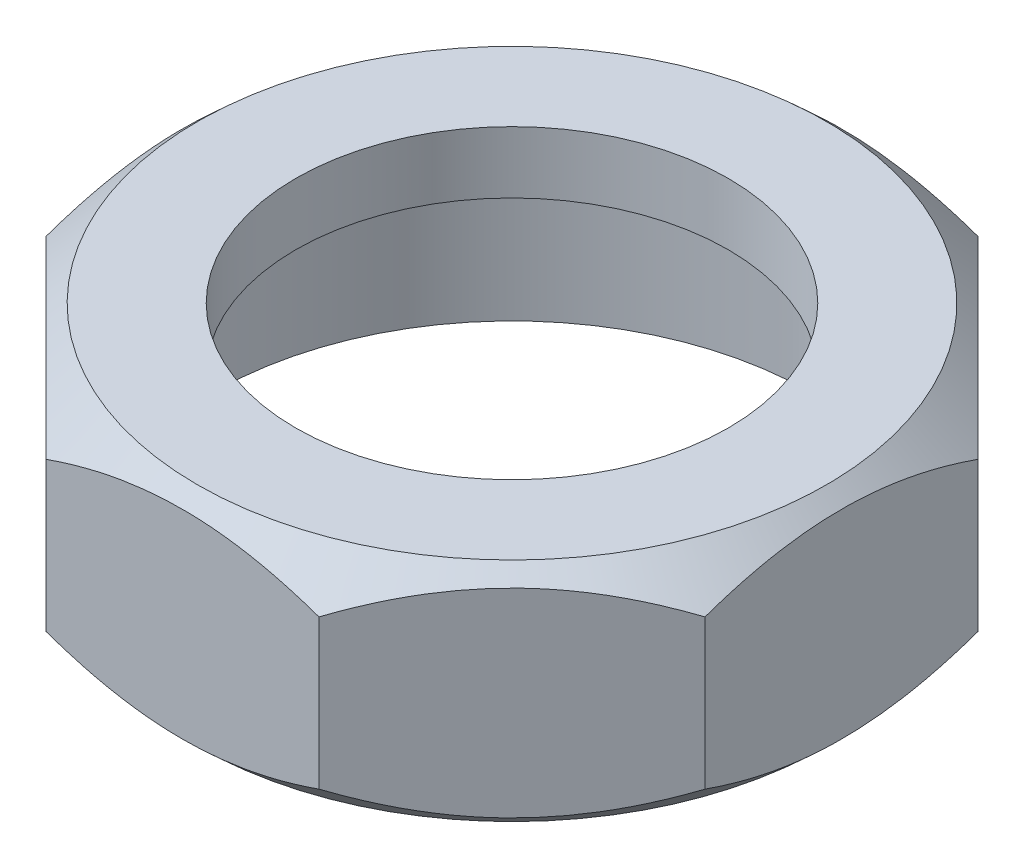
from build123d import *

# Parameters (mm, degrees)
SKETCH1_R           = 10.5
BOSS_EXTRUDE1_DEPTH = 5.5
SKETCH4_R           = 14.5
CUT_EXTRUDE1_DEPTH  = 8


with BuildPart() as part:
    # Sketch1 → Boss-Extrude1 (new, symmetric)
    with BuildSketch(Plane(origin=(0, 0, 0), x_dir=(1, 0, 0), z_dir=(0, 1, 0))):
        Polygon((6.627416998, 16), (-6.627416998, 16), (-16, 6.627416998), (-16, -6.627416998), (-6.627416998, -16), (6.627416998, -16), (16, -6.627416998), (16, 6.627416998), align=None)
        with Locations(Location((0, 0, 0), (0, 0, 270))):
            Circle(SKETCH1_R, mode=Mode.SUBTRACT)
    extrude(amount=BOSS_EXTRUDE1_DEPTH, both=True)

    # Sketch3 → Cut-Revolve1 (revolve, cut)
    with BuildSketch(Plane.XY, mode=Mode.PRIVATE) as cut_revolve1_sk:
        Polygon((-18.5, 2.534445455), (-18.5, 7.5), (-13.1, 7.5), align=None)
        Polygon((-18.5, -7.5), (-13.1, -7.5), (-18.5, -2.534445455), align=None)
    revolve(cut_revolve1_sk.sketch.rotate(Axis((0, 0, 0), (0, 1, 0)), 90), axis=Axis((0, 0, 0), (0, 1, 0)), mode=Mode.SUBTRACT)

    # Sketch4 → Cut-Extrude1 (cut)
    with BuildSketch(Plane.XZ.offset(5.5)):
        with Locations(Location((0, 0, 0), (0, 0, 270))):
            Circle(SKETCH4_R)
    extrude(amount=-CUT_EXTRUDE1_DEPTH, mode=Mode.SUBTRACT)


solid = part.part
